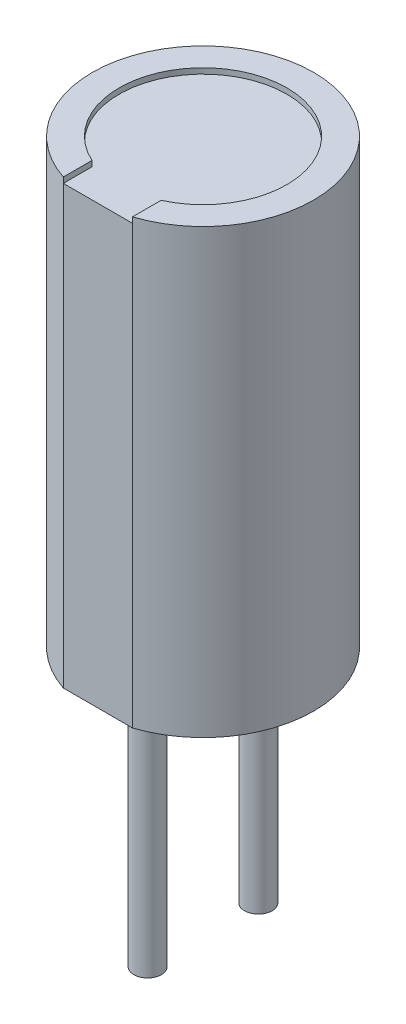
from build123d import *

# Parameters (mm, degrees)
ESQUISSE1_R             = 2
EXTRUSION1_DEPTH        = 8
ESQUISSE2_W             = 2
ESQUISSE2_H             = 8
ENL_V_MAT_EXTRU_1_DEPTH = 0.1
ESQUISSE3_R             = 0.25
EXTRUSION2_DEPTH        = 4.5
ENL_V_MAT_EXTRU_2_DEPTH = 0.1


with BuildPart() as part:
    # Esquisse1 → Extrusion1 (new body)
    with BuildSketch(Plane(origin=(0, 0, 0), x_dir=(1, 0, 0), z_dir=(0, 1, 0))):
        with Locations(Location((0, 0, 0), (0, 0, 270))):
            Circle(ESQUISSE1_R)
    extrude(amount=EXTRUSION1_DEPTH)

    # Esquisse2 → Enl_v. mat.-Extru.1 (cut)
    with BuildSketch(Plane.XY.offset(2)):
        with Locations((0, 4)):
            Rectangle(ESQUISSE2_W, ESQUISSE2_H)
    extrude(amount=-ENL_V_MAT_EXTRU_1_DEPTH, mode=Mode.SUBTRACT)

    # Esquisse3 → Extrusion2 (add)
    with BuildSketch(Plane.XZ):
        with Locations(Location((0, 1, 0), (0, 0, 90))):
            Circle(ESQUISSE3_R)
        with Locations(Location((0, -1, 0), (0, 0, 90))):
            Circle(ESQUISSE3_R)
    extrude(amount=EXTRUSION2_DEPTH)

    # Esquisse4 → Enl_v. mat.-Extru.2 (cut)
    with BuildSketch(Plane(origin=(0, 8, 0), x_dir=(-1, 0, 0), z_dir=(0, 1, 0))):
        with BuildLine():
            Line((-0.6244998, 1.38143931), (-0.6244998, 1.9))
            Line((-0.6244998, 1.9), (0.6244998, 1.9))
            Line((0.6244998, 1.9), (0.6244998, 1.38143931))
            ThreePointArc((0.6244998, 1.38143931), (0, -1.516039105), (-0.6244998, 1.38143931))
        make_face()
    extrude(amount=-ENL_V_MAT_EXTRU_2_DEPTH, mode=Mode.SUBTRACT)


solid = part.part
